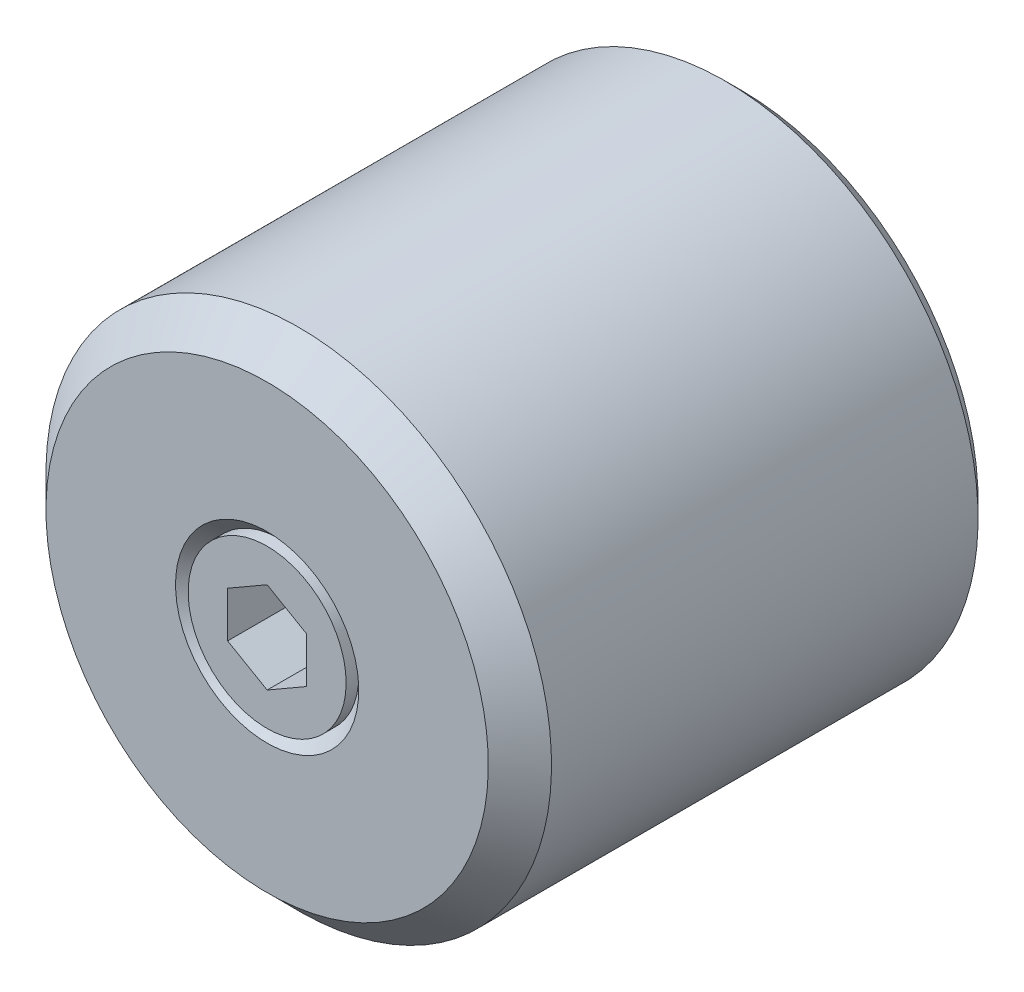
ISO-10303-21;
HEADER;
FILE_DESCRIPTION(('STEP AP214'),'2;1');
FILE_NAME('part.step','',(''),(''),'','','');
FILE_SCHEMA(('AUTOMOTIVE_DESIGN { 1 0 10303 214 1 1 1 1 }'));
ENDSEC;
DATA;
#1=APPLICATION_CONTEXT('core data for automotive mechanical design processes');
#2=APPLICATION_PROTOCOL_DEFINITION('international standard','automotive_design',2000,#1);
#3=PRODUCT_CONTEXT('',#1,'mechanical');
#4=PRODUCT('Part','Part','',(#3));
#5=PRODUCT_RELATED_PRODUCT_CATEGORY('part','',(#4));
#6=PRODUCT_DEFINITION_FORMATION('','',#4);
#7=PRODUCT_DEFINITION_CONTEXT('part definition',#1,'design');
#8=PRODUCT_DEFINITION('design','',#6,#7);
#9=PRODUCT_DEFINITION_SHAPE('','',#8);
#10=(LENGTH_UNIT() NAMED_UNIT(*) SI_UNIT(.MILLI.,.METRE.));
#11=(NAMED_UNIT(*) PLANE_ANGLE_UNIT() SI_UNIT($,.RADIAN.));
#12=(NAMED_UNIT(*) SI_UNIT($,.STERADIAN.) SOLID_ANGLE_UNIT());
#13=UNCERTAINTY_MEASURE_WITH_UNIT(LENGTH_MEASURE(1.E-05),#10,'distance_accuracy_value','');
#14=(GEOMETRIC_REPRESENTATION_CONTEXT(3) GLOBAL_UNCERTAINTY_ASSIGNED_CONTEXT((#13)) GLOBAL_UNIT_ASSIGNED_CONTEXT((#10,
#11,#12)) REPRESENTATION_CONTEXT('',''));
#15=CARTESIAN_POINT('',(0.,0.,0.));
#16=DIRECTION('',(0.,0.,1.));
#17=DIRECTION('',(1.,0.,0.));
#18=AXIS2_PLACEMENT_3D('',#15,#16,#17);
#19=CARTESIAN_POINT('',(0.,0.,30.));
#20=DIRECTION('',(0.,0.,1.));
#21=DIRECTION('',(-0.5,0.866025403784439,0.));
#22=AXIS2_PLACEMENT_3D('',#19,#20,#21);
#23=CYLINDRICAL_SURFACE('',#22,2.5);
#24=CARTESIAN_POINT('',(0.,0.,15.));
#25=DIRECTION('',(0.,0.,1.));
#26=DIRECTION('',(-0.5,0.866025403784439,0.));
#27=AXIS2_PLACEMENT_3D('',#24,#25,#26);
#28=CIRCLE('',#27,2.5);
#29=CARTESIAN_POINT('',(-1.25,2.1650635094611,15.));
#30=VERTEX_POINT('',#29);
#31=EDGE_CURVE('E17',#30,#30,#28,.T.);
#32=ORIENTED_EDGE('',*,*,#31,.F.);
#33=EDGE_LOOP('',(#32));
#34=FACE_BOUND('',#33,.T.);
#35=CARTESIAN_POINT('',(0.,0.,14.6));
#36=DIRECTION('',(0.,0.,1.));
#37=DIRECTION('',(0.866025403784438,0.5,0.));
#38=AXIS2_PLACEMENT_3D('',#35,#36,#37);
#39=CIRCLE('',#38,2.5);
#40=CARTESIAN_POINT('',(2.1650635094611,1.25,14.6));
#41=VERTEX_POINT('',#40);
#42=EDGE_CURVE('E9',#41,#41,#39,.T.);
#43=ORIENTED_EDGE('',*,*,#42,.T.);
#44=EDGE_LOOP('',(#43));
#45=FACE_BOUND('',#44,.T.);
#46=ADVANCED_FACE('F14',(#34,#45),#23,.T.);
#47=CARTESIAN_POINT('',(-1.25,-0.721687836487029,13.));
#48=DIRECTION('',(1.,0.,0.));
#49=DIRECTION('',(0.,1.,0.));
#50=AXIS2_PLACEMENT_3D('',#47,#48,#49);
#51=PLANE('',#50);
#52=DIRECTION('',(0.,0.,1.));
#53=VECTOR('',#52,1.);
#54=CARTESIAN_POINT('',(-1.25,0.721687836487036,13.));
#55=LINE('',#54,#53);
#56=CARTESIAN_POINT('',(-1.25,0.721687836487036,13.));
#57=VERTEX_POINT('',#56);
#58=CARTESIAN_POINT('',(-1.25,0.721687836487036,15.));
#59=VERTEX_POINT('',#58);
#60=EDGE_CURVE('E64',#57,#59,#55,.T.);
#61=ORIENTED_EDGE('',*,*,#60,.T.);
#62=DIRECTION('',(0.,1.,0.));
#63=VECTOR('',#62,1.);
#64=CARTESIAN_POINT('',(-1.25,-0.721687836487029,15.));
#65=LINE('',#64,#63);
#66=CARTESIAN_POINT('',(-1.25,-0.721687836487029,15.));
#67=VERTEX_POINT('',#66);
#68=EDGE_CURVE('E30',#67,#59,#65,.T.);
#69=ORIENTED_EDGE('',*,*,#68,.F.);
#70=DIRECTION('',(0.,0.,1.));
#71=VECTOR('',#70,1.);
#72=CARTESIAN_POINT('',(-1.25,-0.721687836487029,13.));
#73=LINE('',#72,#71);
#74=CARTESIAN_POINT('',(-1.25,-0.721687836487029,13.));
#75=VERTEX_POINT('',#74);
#76=EDGE_CURVE('E34',#75,#67,#73,.T.);
#77=ORIENTED_EDGE('',*,*,#76,.F.);
#78=DIRECTION('',(0.,1.,0.));
#79=VECTOR('',#78,1.);
#80=CARTESIAN_POINT('',(-1.25,-0.721687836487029,13.));
#81=LINE('',#80,#79);
#82=EDGE_CURVE('E67',#75,#57,#81,.T.);
#83=ORIENTED_EDGE('',*,*,#82,.T.);
#84=EDGE_LOOP('',(#61,#69,#77,#83));
#85=FACE_BOUND('',#84,.T.);
#86=ADVANCED_FACE('F66',(#85),#51,.T.);
#87=CARTESIAN_POINT('',(-1.25,0.721687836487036,13.));
#88=DIRECTION('',(0.5,-0.866025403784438,0.));
#89=DIRECTION('',(0.866025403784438,0.5,0.));
#90=AXIS2_PLACEMENT_3D('',#87,#88,#89);
#91=PLANE('',#90);
#92=DIRECTION('',(0.,0.,1.));
#93=VECTOR('',#92,1.);
#94=CARTESIAN_POINT('',(0.,1.44337567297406,13.));
#95=LINE('',#94,#93);
#96=CARTESIAN_POINT('',(0.,1.44337567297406,13.));
#97=VERTEX_POINT('',#96);
#98=CARTESIAN_POINT('',(0.,1.44337567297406,15.));
#99=VERTEX_POINT('',#98);
#100=EDGE_CURVE('E71',#97,#99,#95,.T.);
#101=ORIENTED_EDGE('',*,*,#100,.T.);
#102=DIRECTION('',(0.866025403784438,0.5,0.));
#103=VECTOR('',#102,1.);
#104=CARTESIAN_POINT('',(-1.25,0.721687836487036,15.));
#105=LINE('',#104,#103);
#106=EDGE_CURVE('E73',#59,#99,#105,.T.);
#107=ORIENTED_EDGE('',*,*,#106,.F.);
#108=ORIENTED_EDGE('',*,*,#60,.F.);
#109=DIRECTION('',(0.866025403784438,0.5,0.));
#110=VECTOR('',#109,1.);
#111=CARTESIAN_POINT('',(-1.25,0.721687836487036,13.));
#112=LINE('',#111,#110);
#113=EDGE_CURVE('E100',#57,#97,#112,.T.);
#114=ORIENTED_EDGE('',*,*,#113,.T.);
#115=EDGE_LOOP('',(#101,#107,#108,#114));
#116=FACE_BOUND('',#115,.T.);
#117=ADVANCED_FACE('F74',(#116),#91,.T.);
#118=CARTESIAN_POINT('',(1.25,0.721687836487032,13.));
#119=DIRECTION('',(0.5,0.866025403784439,0.));
#120=DIRECTION('',(-0.866025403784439,0.5,0.));
#121=AXIS2_PLACEMENT_3D('',#118,#119,#120);
#122=PLANE('',#121);
#123=DIRECTION('',(0.,0.,1.));
#124=VECTOR('',#123,1.);
#125=CARTESIAN_POINT('',(1.25,0.721687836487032,13.));
#126=LINE('',#125,#124);
#127=CARTESIAN_POINT('',(1.25,0.721687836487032,13.));
#128=VERTEX_POINT('',#127);
#129=CARTESIAN_POINT('',(1.25,0.721687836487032,15.));
#130=VERTEX_POINT('',#129);
#131=EDGE_CURVE('E108',#128,#130,#126,.T.);
#132=ORIENTED_EDGE('',*,*,#131,.T.);
#133=DIRECTION('',(-0.866025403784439,0.5,0.));
#134=VECTOR('',#133,1.);
#135=CARTESIAN_POINT('',(1.25,0.721687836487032,15.));
#136=LINE('',#135,#134);
#137=EDGE_CURVE('E78',#130,#99,#136,.T.);
#138=ORIENTED_EDGE('',*,*,#137,.T.);
#139=ORIENTED_EDGE('',*,*,#100,.F.);
#140=DIRECTION('',(-0.866025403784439,0.5,0.));
#141=VECTOR('',#140,1.);
#142=CARTESIAN_POINT('',(1.25,0.721687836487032,13.));
#143=LINE('',#142,#141);
#144=EDGE_CURVE('E97',#128,#97,#143,.T.);
#145=ORIENTED_EDGE('',*,*,#144,.F.);
#146=EDGE_LOOP('',(#132,#138,#139,#145));
#147=FACE_BOUND('',#146,.T.);
#148=ADVANCED_FACE('F113',(#147),#122,.F.);
#149=CARTESIAN_POINT('',(1.25,0.721687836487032,13.));
#150=DIRECTION('',(-1.,0.,0.));
#151=DIRECTION('',(0.,-1.,0.));
#152=AXIS2_PLACEMENT_3D('',#149,#150,#151);
#153=PLANE('',#152);
#154=DIRECTION('',(0.,0.,1.));
#155=VECTOR('',#154,1.);
#156=CARTESIAN_POINT('',(1.25000000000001,-0.721687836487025,13.));
#157=LINE('',#156,#155);
#158=CARTESIAN_POINT('',(1.25000000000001,-0.721687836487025,13.));
#159=VERTEX_POINT('',#158);
#160=CARTESIAN_POINT('',(1.25000000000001,-0.721687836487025,15.));
#161=VERTEX_POINT('',#160);
#162=EDGE_CURVE('E106',#159,#161,#157,.T.);
#163=ORIENTED_EDGE('',*,*,#162,.T.);
#164=DIRECTION('',(0.,-1.,0.));
#165=VECTOR('',#164,1.);
#166=CARTESIAN_POINT('',(1.25,0.721687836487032,15.));
#167=LINE('',#166,#165);
#168=EDGE_CURVE('E117',#130,#161,#167,.T.);
#169=ORIENTED_EDGE('',*,*,#168,.F.);
#170=ORIENTED_EDGE('',*,*,#131,.F.);
#171=DIRECTION('',(0.,-1.,0.));
#172=VECTOR('',#171,1.);
#173=CARTESIAN_POINT('',(1.25,0.721687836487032,13.));
#174=LINE('',#173,#172);
#175=EDGE_CURVE('E94',#128,#159,#174,.T.);
#176=ORIENTED_EDGE('',*,*,#175,.T.);
#177=EDGE_LOOP('',(#163,#169,#170,#176));
#178=FACE_BOUND('',#177,.T.);
#179=ADVANCED_FACE('F118',(#178),#153,.T.);
#180=CARTESIAN_POINT('',(0.,-1.44337567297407,13.));
#181=DIRECTION('',(0.5,-0.866025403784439,0.));
#182=DIRECTION('',(0.,0.,1.));
#183=AXIS2_PLACEMENT_3D('',#180,#181,#182);
#184=PLANE('',#183);
#185=DIRECTION('',(0.,0.,1.));
#186=VECTOR('',#185,1.);
#187=CARTESIAN_POINT('',(0.,-1.44337567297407,13.));
#188=LINE('',#187,#186);
#189=CARTESIAN_POINT('',(0.,-1.44337567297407,13.));
#190=VERTEX_POINT('',#189);
#191=CARTESIAN_POINT('',(0.,-1.44337567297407,15.));
#192=VERTEX_POINT('',#191);
#193=EDGE_CURVE('E104',#190,#192,#188,.T.);
#194=ORIENTED_EDGE('',*,*,#193,.T.);
#195=DIRECTION('',(0.866025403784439,0.5,0.));
#196=VECTOR('',#195,1.);
#197=CARTESIAN_POINT('',(0.,-1.44337567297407,15.));
#198=LINE('',#197,#196);
#199=EDGE_CURVE('E120',#192,#161,#198,.T.);
#200=ORIENTED_EDGE('',*,*,#199,.T.);
#201=ORIENTED_EDGE('',*,*,#162,.F.);
#202=DIRECTION('',(0.866025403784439,0.5,0.));
#203=VECTOR('',#202,1.);
#204=CARTESIAN_POINT('',(0.,-1.44337567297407,13.));
#205=LINE('',#204,#203);
#206=EDGE_CURVE('E91',#190,#159,#205,.T.);
#207=ORIENTED_EDGE('',*,*,#206,.F.);
#208=EDGE_LOOP('',(#194,#200,#201,#207));
#209=FACE_BOUND('',#208,.T.);
#210=ADVANCED_FACE('F181',(#209),#184,.F.);
#211=CARTESIAN_POINT('',(-1.25,-0.721687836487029,13.));
#212=DIRECTION('',(-0.500000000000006,-0.866025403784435,0.));
#213=DIRECTION('',(0.866025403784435,-0.500000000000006,0.));
#214=AXIS2_PLACEMENT_3D('',#211,#212,#213);
#215=PLANE('',#214);
#216=DIRECTION('',(0.866025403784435,-0.500000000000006,0.));
#217=VECTOR('',#216,1.);
#218=CARTESIAN_POINT('',(-1.25,-0.721687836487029,13.));
#219=LINE('',#218,#217);
#220=EDGE_CURVE('E88',#75,#190,#219,.T.);
#221=ORIENTED_EDGE('',*,*,#220,.F.);
#222=ORIENTED_EDGE('',*,*,#76,.T.);
#223=DIRECTION('',(0.866025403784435,-0.500000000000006,0.));
#224=VECTOR('',#223,1.);
#225=CARTESIAN_POINT('',(-1.25,-0.721687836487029,15.));
#226=LINE('',#225,#224);
#227=EDGE_CURVE('E84',#67,#192,#226,.T.);
#228=ORIENTED_EDGE('',*,*,#227,.T.);
#229=ORIENTED_EDGE('',*,*,#193,.F.);
#230=EDGE_LOOP('',(#221,#222,#228,#229));
#231=FACE_BOUND('',#230,.T.);
#232=ADVANCED_FACE('F179',(#231),#215,.F.);
#233=CARTESIAN_POINT('',(-1.25,2.1650635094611,13.));
#234=DIRECTION('',(0.,0.,1.));
#235=DIRECTION('',(-0.5,0.866025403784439,0.));
#236=AXIS2_PLACEMENT_3D('',#233,#234,#235);
#237=PLANE('',#236);
#238=ORIENTED_EDGE('',*,*,#82,.F.);
#239=ORIENTED_EDGE('',*,*,#220,.T.);
#240=ORIENTED_EDGE('',*,*,#206,.T.);
#241=ORIENTED_EDGE('',*,*,#175,.F.);
#242=ORIENTED_EDGE('',*,*,#144,.T.);
#243=ORIENTED_EDGE('',*,*,#113,.F.);
#244=EDGE_LOOP('',(#238,#239,#240,#241,#242,#243));
#245=FACE_BOUND('',#244,.T.);
#246=ADVANCED_FACE('F176',(#245),#237,.T.);
#247=CARTESIAN_POINT('',(-1.25,2.1650635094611,15.));
#248=DIRECTION('',(0.,0.,-1.));
#249=DIRECTION('',(0.5,-0.866025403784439,0.));
#250=AXIS2_PLACEMENT_3D('',#247,#248,#249);
#251=PLANE('',#250);
#252=ORIENTED_EDGE('',*,*,#31,.T.);
#253=EDGE_LOOP('',(#252));
#254=FACE_BOUND('',#253,.T.);
#255=ORIENTED_EDGE('',*,*,#68,.T.);
#256=ORIENTED_EDGE('',*,*,#106,.T.);
#257=ORIENTED_EDGE('',*,*,#137,.F.);
#258=ORIENTED_EDGE('',*,*,#168,.T.);
#259=ORIENTED_EDGE('',*,*,#199,.F.);
#260=ORIENTED_EDGE('',*,*,#227,.F.);
#261=EDGE_LOOP('',(#255,#256,#257,#258,#259,#260));
#262=FACE_BOUND('',#261,.T.);
#263=ADVANCED_FACE('F81',(#254,#262),#251,.F.);
#264=CARTESIAN_POINT('',(0.,0.,15.));
#265=DIRECTION('',(0.,0.,-1.));
#266=DIRECTION('',(0.5,-0.866025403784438,0.));
#267=AXIS2_PLACEMENT_3D('',#264,#265,#266);
#268=CYLINDRICAL_SURFACE('',#267,8.);
#269=CARTESIAN_POINT('',(0.,0.,0.5));
#270=DIRECTION('',(0.,0.,1.));
#271=DIRECTION('',(-0.5,0.866025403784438,0.));
#272=AXIS2_PLACEMENT_3D('',#269,#270,#271);
#273=CIRCLE('',#272,8.);
#274=CARTESIAN_POINT('',(-4.,6.9282032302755,0.5));
#275=VERTEX_POINT('',#274);
#276=EDGE_CURVE('E22',#275,#275,#273,.T.);
#277=ORIENTED_EDGE('',*,*,#276,.T.);
#278=EDGE_LOOP('',(#277));
#279=FACE_BOUND('',#278,.T.);
#280=CARTESIAN_POINT('',(0.,0.,14.));
#281=DIRECTION('',(0.,0.,1.));
#282=DIRECTION('',(-0.5,0.866025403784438,0.));
#283=AXIS2_PLACEMENT_3D('',#280,#281,#282);
#284=CIRCLE('',#283,8.);
#285=CARTESIAN_POINT('',(-4.,6.9282032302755,14.));
#286=VERTEX_POINT('',#285);
#287=EDGE_CURVE('E130',#286,#286,#284,.F.);
#288=ORIENTED_EDGE('',*,*,#287,.T.);
#289=EDGE_LOOP('',(#288));
#290=FACE_BOUND('',#289,.T.);
#291=ADVANCED_FACE('F168',(#279,#290),#268,.T.);
#292=CARTESIAN_POINT('',(0.,0.,15.));
#293=DIRECTION('',(0.,0.,-1.));
#294=DIRECTION('',(0.5,-0.866025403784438,0.));
#295=AXIS2_PLACEMENT_3D('',#292,#293,#294);
#296=CONICAL_SURFACE('',#295,7.,0.785398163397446);
#297=ORIENTED_EDGE('',*,*,#287,.F.);
#298=EDGE_LOOP('',(#297));
#299=FACE_BOUND('',#298,.T.);
#300=CARTESIAN_POINT('',(0.,0.,15.));
#301=DIRECTION('',(0.,0.,1.));
#302=DIRECTION('',(-0.5,0.866025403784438,0.));
#303=AXIS2_PLACEMENT_3D('',#300,#301,#302);
#304=CIRCLE('',#303,7.);
#305=CARTESIAN_POINT('',(-3.5,6.06217782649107,15.));
#306=VERTEX_POINT('',#305);
#307=EDGE_CURVE('E133',#306,#306,#304,.T.);
#308=ORIENTED_EDGE('',*,*,#307,.F.);
#309=EDGE_LOOP('',(#308));
#310=FACE_BOUND('',#309,.T.);
#311=ADVANCED_FACE('F162',(#299,#310),#296,.T.);
#312=CARTESIAN_POINT('',(0.,0.,15.));
#313=DIRECTION('',(0.,0.,1.));
#314=DIRECTION('',(-0.5,0.866025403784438,0.));
#315=AXIS2_PLACEMENT_3D('',#312,#313,#314);
#316=PLANE('',#315);
#317=CARTESIAN_POINT('',(0.,0.,15.));
#318=DIRECTION('',(0.,0.,1.));
#319=DIRECTION('',(-0.5,0.866025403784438,0.));
#320=AXIS2_PLACEMENT_3D('',#317,#318,#319);
#321=CIRCLE('',#320,2.9);
#322=CARTESIAN_POINT('',(-1.45,2.51147367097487,15.));
#323=VERTEX_POINT('',#322);
#324=EDGE_CURVE('E136',#323,#323,#321,.T.);
#325=ORIENTED_EDGE('',*,*,#324,.F.);
#326=EDGE_LOOP('',(#325));
#327=FACE_BOUND('',#326,.T.);
#328=ORIENTED_EDGE('',*,*,#307,.T.);
#329=EDGE_LOOP('',(#328));
#330=FACE_BOUND('',#329,.T.);
#331=ADVANCED_FACE('F151',(#327,#330),#316,.T.);
#332=CARTESIAN_POINT('',(0.,0.,15.));
#333=DIRECTION('',(0.,0.,1.));
#334=DIRECTION('',(-0.5,0.866025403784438,0.));
#335=AXIS2_PLACEMENT_3D('',#332,#333,#334);
#336=CONICAL_SURFACE('',#335,2.9,0.785398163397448);
#337=ORIENTED_EDGE('',*,*,#324,.T.);
#338=EDGE_LOOP('',(#337));
#339=FACE_BOUND('',#338,.T.);
#340=ORIENTED_EDGE('',*,*,#42,.F.);
#341=EDGE_LOOP('',(#340));
#342=FACE_BOUND('',#341,.T.);
#343=ADVANCED_FACE('F148',(#339,#342),#336,.F.);
#344=CARTESIAN_POINT('',(0.,0.,0.5));
#345=DIRECTION('',(0.,0.,1.));
#346=DIRECTION('',(-0.5,0.866025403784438,0.));
#347=AXIS2_PLACEMENT_3D('',#344,#345,#346);
#348=CONICAL_SURFACE('',#347,8.,0.78539816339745);
#349=CARTESIAN_POINT('',(0.,0.,0.));
#350=DIRECTION('',(0.,0.,1.));
#351=DIRECTION('',(-0.5,0.866025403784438,0.));
#352=AXIS2_PLACEMENT_3D('',#349,#350,#351);
#353=CIRCLE('',#352,7.5);
#354=CARTESIAN_POINT('',(-3.75,6.49519052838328,0.));
#355=VERTEX_POINT('',#354);
#356=EDGE_CURVE('E127',#355,#355,#353,.F.);
#357=ORIENTED_EDGE('',*,*,#356,.F.);
#358=EDGE_LOOP('',(#357));
#359=FACE_BOUND('',#358,.T.);
#360=ORIENTED_EDGE('',*,*,#276,.F.);
#361=EDGE_LOOP('',(#360));
#362=FACE_BOUND('',#361,.T.);
#363=ADVANCED_FACE('F150',(#359,#362),#348,.T.);
#364=CARTESIAN_POINT('',(0.,0.,0.));
#365=DIRECTION('',(0.,0.,1.));
#366=DIRECTION('',(-0.5,0.866025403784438,0.));
#367=AXIS2_PLACEMENT_3D('',#364,#365,#366);
#368=PLANE('',#367);
#369=ORIENTED_EDGE('',*,*,#356,.T.);
#370=EDGE_LOOP('',(#369));
#371=FACE_BOUND('',#370,.T.);
#372=ADVANCED_FACE('F159',(#371),#368,.F.);
#373=CLOSED_SHELL('',(#46,#86,#117,#148,#179,#210,#232,#246,#263,#291,#311,#331,#343,#363,#372));
#374=MANIFOLD_SOLID_BREP('B1',#373);
#375=ADVANCED_BREP_SHAPE_REPRESENTATION('',(#18,#374),#14);
#376=SHAPE_DEFINITION_REPRESENTATION(#9,#375);
ENDSEC;
END-ISO-10303-21;
